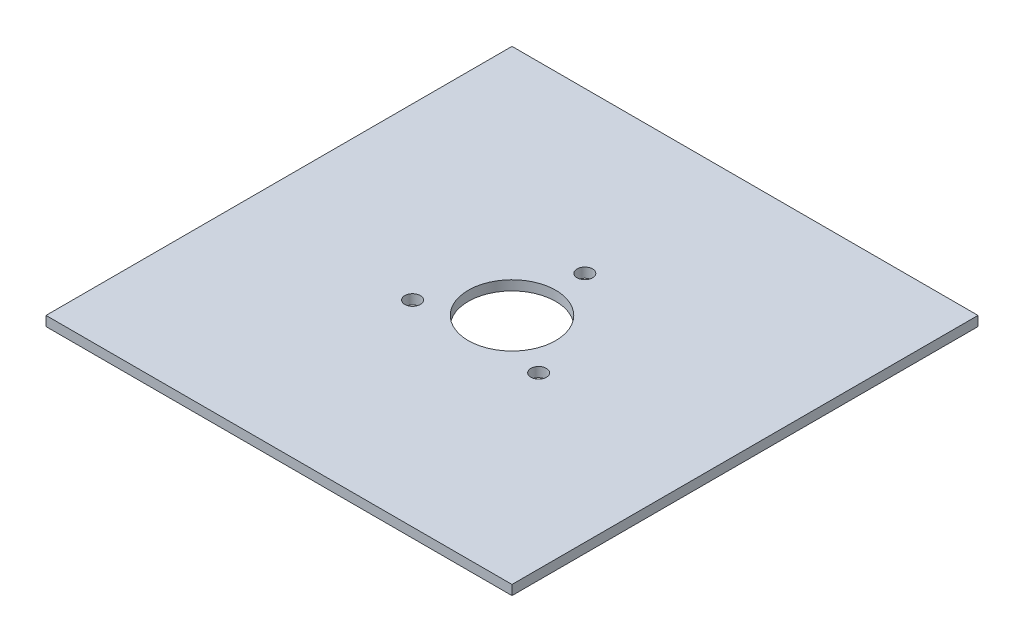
ISO-10303-21;
HEADER;
FILE_DESCRIPTION(('STEP AP214'),'2;1');
FILE_NAME('part.step','',(''),(''),'','','');
FILE_SCHEMA(('AUTOMOTIVE_DESIGN { 1 0 10303 214 1 1 1 1 }'));
ENDSEC;
DATA;
#1=APPLICATION_CONTEXT('core data for automotive mechanical design processes');
#2=APPLICATION_PROTOCOL_DEFINITION('international standard','automotive_design',2000,#1);
#3=PRODUCT_CONTEXT('',#1,'mechanical');
#4=PRODUCT('Part','Part','',(#3));
#5=PRODUCT_RELATED_PRODUCT_CATEGORY('part','',(#4));
#6=PRODUCT_DEFINITION_FORMATION('','',#4);
#7=PRODUCT_DEFINITION_CONTEXT('part definition',#1,'design');
#8=PRODUCT_DEFINITION('design','',#6,#7);
#9=PRODUCT_DEFINITION_SHAPE('','',#8);
#10=(LENGTH_UNIT() NAMED_UNIT(*) SI_UNIT(.MILLI.,.METRE.));
#11=(NAMED_UNIT(*) PLANE_ANGLE_UNIT() SI_UNIT($,.RADIAN.));
#12=(NAMED_UNIT(*) SI_UNIT($,.STERADIAN.) SOLID_ANGLE_UNIT());
#13=UNCERTAINTY_MEASURE_WITH_UNIT(LENGTH_MEASURE(1.E-05),#10,'distance_accuracy_value','');
#14=(GEOMETRIC_REPRESENTATION_CONTEXT(3) GLOBAL_UNCERTAINTY_ASSIGNED_CONTEXT((#13)) GLOBAL_UNIT_ASSIGNED_CONTEXT((#10,
#11,#12)) REPRESENTATION_CONTEXT('',''));
#15=CARTESIAN_POINT('',(0.,0.,0.));
#16=DIRECTION('',(0.,0.,1.));
#17=DIRECTION('',(1.,0.,0.));
#18=AXIS2_PLACEMENT_3D('',#15,#16,#17);
#19=CARTESIAN_POINT('',(76.2,1.5875,76.2));
#20=DIRECTION('',(-1.,0.,0.));
#21=DIRECTION('',(0.,0.,1.));
#22=AXIS2_PLACEMENT_3D('',#19,#20,#21);
#23=PLANE('',#22);
#24=DIRECTION('',(0.,0.,-1.));
#25=VECTOR('',#24,1.);
#26=CARTESIAN_POINT('',(76.2,-1.5875,76.2));
#27=LINE('',#26,#25);
#28=CARTESIAN_POINT('',(76.2,-1.5875,76.2));
#29=VERTEX_POINT('',#28);
#30=CARTESIAN_POINT('',(76.2,-1.5875,-76.2));
#31=VERTEX_POINT('',#30);
#32=EDGE_CURVE('E95',#29,#31,#27,.T.);
#33=ORIENTED_EDGE('',*,*,#32,.T.);
#34=DIRECTION('',(0.,-1.,0.));
#35=VECTOR('',#34,1.);
#36=CARTESIAN_POINT('',(76.2,1.5875,-76.2));
#37=LINE('',#36,#35);
#38=CARTESIAN_POINT('',(76.2,1.5875,-76.2));
#39=VERTEX_POINT('',#38);
#40=EDGE_CURVE('E11',#39,#31,#37,.T.);
#41=ORIENTED_EDGE('',*,*,#40,.F.);
#42=DIRECTION('',(0.,0.,-1.));
#43=VECTOR('',#42,1.);
#44=CARTESIAN_POINT('',(76.2,1.5875,76.2));
#45=LINE('',#44,#43);
#46=CARTESIAN_POINT('',(76.2,1.5875,76.2));
#47=VERTEX_POINT('',#46);
#48=EDGE_CURVE('E83',#47,#39,#45,.T.);
#49=ORIENTED_EDGE('',*,*,#48,.F.);
#50=DIRECTION('',(0.,-1.,0.));
#51=VECTOR('',#50,1.);
#52=CARTESIAN_POINT('',(76.2,1.5875,76.2));
#53=LINE('',#52,#51);
#54=EDGE_CURVE('E91',#47,#29,#53,.T.);
#55=ORIENTED_EDGE('',*,*,#54,.T.);
#56=EDGE_LOOP('',(#33,#41,#49,#55));
#57=FACE_BOUND('',#56,.T.);
#58=ADVANCED_FACE('F32',(#57),#23,.F.);
#59=CARTESIAN_POINT('',(-76.2,1.5875,-76.2));
#60=DIRECTION('',(0.,0.,1.));
#61=DIRECTION('',(1.,0.,0.));
#62=AXIS2_PLACEMENT_3D('',#59,#60,#61);
#63=PLANE('',#62);
#64=DIRECTION('',(-1.,0.,0.));
#65=VECTOR('',#64,1.);
#66=CARTESIAN_POINT('',(-76.2,-1.5875,-76.2));
#67=LINE('',#66,#65);
#68=CARTESIAN_POINT('',(-76.2,-1.5875,-76.2));
#69=VERTEX_POINT('',#68);
#70=EDGE_CURVE('E87',#31,#69,#67,.T.);
#71=ORIENTED_EDGE('',*,*,#70,.T.);
#72=DIRECTION('',(0.,-1.,0.));
#73=VECTOR('',#72,1.);
#74=CARTESIAN_POINT('',(-76.2,1.5875,-76.2));
#75=LINE('',#74,#73);
#76=CARTESIAN_POINT('',(-76.2,1.5875,-76.2));
#77=VERTEX_POINT('',#76);
#78=EDGE_CURVE('E40',#77,#69,#75,.T.);
#79=ORIENTED_EDGE('',*,*,#78,.F.);
#80=DIRECTION('',(-1.,0.,0.));
#81=VECTOR('',#80,1.);
#82=CARTESIAN_POINT('',(-76.2,1.5875,-76.2));
#83=LINE('',#82,#81);
#84=EDGE_CURVE('E78',#39,#77,#83,.T.);
#85=ORIENTED_EDGE('',*,*,#84,.F.);
#86=ORIENTED_EDGE('',*,*,#40,.T.);
#87=EDGE_LOOP('',(#71,#79,#85,#86));
#88=FACE_BOUND('',#87,.T.);
#89=ADVANCED_FACE('F86',(#88),#63,.F.);
#90=CARTESIAN_POINT('',(-76.2,1.5875,76.2));
#91=DIRECTION('',(1.,0.,0.));
#92=DIRECTION('',(0.,0.,-1.));
#93=AXIS2_PLACEMENT_3D('',#90,#91,#92);
#94=PLANE('',#93);
#95=DIRECTION('',(0.,0.,1.));
#96=VECTOR('',#95,1.);
#97=CARTESIAN_POINT('',(-76.2,-1.5875,76.2));
#98=LINE('',#97,#96);
#99=CARTESIAN_POINT('',(-76.2,-1.5875,76.2));
#100=VERTEX_POINT('',#99);
#101=EDGE_CURVE('E65',#69,#100,#98,.T.);
#102=ORIENTED_EDGE('',*,*,#101,.T.);
#103=DIRECTION('',(0.,-1.,0.));
#104=VECTOR('',#103,1.);
#105=CARTESIAN_POINT('',(-76.2,1.5875,76.2));
#106=LINE('',#105,#104);
#107=CARTESIAN_POINT('',(-76.2,1.5875,76.2));
#108=VERTEX_POINT('',#107);
#109=EDGE_CURVE('E88',#108,#100,#106,.T.);
#110=ORIENTED_EDGE('',*,*,#109,.F.);
#111=DIRECTION('',(0.,0.,1.));
#112=VECTOR('',#111,1.);
#113=CARTESIAN_POINT('',(-76.2,1.5875,76.2));
#114=LINE('',#113,#112);
#115=EDGE_CURVE('E81',#77,#108,#114,.T.);
#116=ORIENTED_EDGE('',*,*,#115,.F.);
#117=ORIENTED_EDGE('',*,*,#78,.T.);
#118=EDGE_LOOP('',(#102,#110,#116,#117));
#119=FACE_BOUND('',#118,.T.);
#120=ADVANCED_FACE('F89',(#119),#94,.F.);
#121=CARTESIAN_POINT('',(-76.2,1.5875,76.2));
#122=DIRECTION('',(0.,0.,-1.));
#123=DIRECTION('',(-1.,0.,0.));
#124=AXIS2_PLACEMENT_3D('',#121,#122,#123);
#125=PLANE('',#124);
#126=DIRECTION('',(1.,0.,0.));
#127=VECTOR('',#126,1.);
#128=CARTESIAN_POINT('',(-76.2,-1.5875,76.2));
#129=LINE('',#128,#127);
#130=EDGE_CURVE('E71',#100,#29,#129,.T.);
#131=ORIENTED_EDGE('',*,*,#130,.T.);
#132=ORIENTED_EDGE('',*,*,#54,.F.);
#133=DIRECTION('',(1.,0.,0.));
#134=VECTOR('',#133,1.);
#135=CARTESIAN_POINT('',(-76.2,1.5875,76.2));
#136=LINE('',#135,#134);
#137=EDGE_CURVE('E48',#108,#47,#136,.T.);
#138=ORIENTED_EDGE('',*,*,#137,.F.);
#139=ORIENTED_EDGE('',*,*,#109,.T.);
#140=EDGE_LOOP('',(#131,#132,#138,#139));
#141=FACE_BOUND('',#140,.T.);
#142=ADVANCED_FACE('F103',(#141),#125,.F.);
#143=CARTESIAN_POINT('',(76.1999999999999,1.5875,-76.2));
#144=DIRECTION('',(0.,-1.,0.));
#145=DIRECTION('',(0.,0.,-1.));
#146=AXIS2_PLACEMENT_3D('',#143,#144,#145);
#147=PLANE('',#146);
#148=CARTESIAN_POINT('',(-20.6222299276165,1.5875,11.9062500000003));
#149=DIRECTION('',(0.,1.,0.));
#150=DIRECTION('',(0.,0.,1.));
#151=AXIS2_PLACEMENT_3D('',#148,#149,#150);
#152=CIRCLE('',#151,2.54);
#153=CARTESIAN_POINT('',(-20.6222299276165,1.5875,14.4462500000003));
#154=VERTEX_POINT('',#153);
#155=EDGE_CURVE('E127',#154,#154,#152,.T.);
#156=ORIENTED_EDGE('',*,*,#155,.F.);
#157=EDGE_LOOP('',(#156));
#158=FACE_BOUND('',#157,.T.);
#159=CARTESIAN_POINT('',(20.6222299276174,1.5875,11.9062499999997));
#160=DIRECTION('',(0.,1.,0.));
#161=DIRECTION('',(0.,0.,1.));
#162=AXIS2_PLACEMENT_3D('',#159,#160,#161);
#163=CIRCLE('',#162,2.54);
#164=CARTESIAN_POINT('',(20.6222299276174,1.5875,14.4462499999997));
#165=VERTEX_POINT('',#164);
#166=EDGE_CURVE('E121',#165,#165,#163,.T.);
#167=ORIENTED_EDGE('',*,*,#166,.F.);
#168=EDGE_LOOP('',(#167));
#169=FACE_BOUND('',#168,.T.);
#170=CARTESIAN_POINT('',(0.,1.5875,-23.8125));
#171=DIRECTION('',(0.,1.,0.));
#172=DIRECTION('',(0.,0.,1.));
#173=AXIS2_PLACEMENT_3D('',#170,#171,#172);
#174=CIRCLE('',#173,2.54);
#175=CARTESIAN_POINT('',(0.,1.5875,-21.2725));
#176=VERTEX_POINT('',#175);
#177=EDGE_CURVE('E115',#176,#176,#174,.T.);
#178=ORIENTED_EDGE('',*,*,#177,.F.);
#179=EDGE_LOOP('',(#178));
#180=FACE_BOUND('',#179,.T.);
#181=CARTESIAN_POINT('',(0.,1.5875,0.));
#182=DIRECTION('',(0.,1.,0.));
#183=DIRECTION('',(0.,0.,1.));
#184=AXIS2_PLACEMENT_3D('',#181,#182,#183);
#185=CIRCLE('',#184,14.2875);
#186=CARTESIAN_POINT('',(0.,1.5875,14.2875));
#187=VERTEX_POINT('',#186);
#188=EDGE_CURVE('E109',#187,#187,#185,.T.);
#189=ORIENTED_EDGE('',*,*,#188,.F.);
#190=EDGE_LOOP('',(#189));
#191=FACE_BOUND('',#190,.T.);
#192=ORIENTED_EDGE('',*,*,#48,.T.);
#193=ORIENTED_EDGE('',*,*,#84,.T.);
#194=ORIENTED_EDGE('',*,*,#115,.T.);
#195=ORIENTED_EDGE('',*,*,#137,.T.);
#196=EDGE_LOOP('',(#192,#193,#194,#195));
#197=FACE_BOUND('',#196,.T.);
#198=ADVANCED_FACE('F79',(#158,#169,#180,#191,#197),#147,.F.);
#199=CARTESIAN_POINT('',(76.1999999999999,-1.5875,-76.2));
#200=DIRECTION('',(0.,-1.,0.));
#201=DIRECTION('',(0.,0.,-1.));
#202=AXIS2_PLACEMENT_3D('',#199,#200,#201);
#203=PLANE('',#202);
#204=CARTESIAN_POINT('',(-20.6222299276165,-1.5875,11.9062500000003));
#205=DIRECTION('',(0.,1.,0.));
#206=DIRECTION('',(0.,0.,1.));
#207=AXIS2_PLACEMENT_3D('',#204,#205,#206);
#208=CIRCLE('',#207,2.54);
#209=CARTESIAN_POINT('',(-20.6222299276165,-1.5875,14.4462500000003));
#210=VERTEX_POINT('',#209);
#211=EDGE_CURVE('E124',#210,#210,#208,.T.);
#212=ORIENTED_EDGE('',*,*,#211,.T.);
#213=EDGE_LOOP('',(#212));
#214=FACE_BOUND('',#213,.T.);
#215=CARTESIAN_POINT('',(20.6222299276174,-1.5875,11.9062499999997));
#216=DIRECTION('',(0.,1.,0.));
#217=DIRECTION('',(0.,0.,1.));
#218=AXIS2_PLACEMENT_3D('',#215,#216,#217);
#219=CIRCLE('',#218,2.54);
#220=CARTESIAN_POINT('',(20.6222299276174,-1.5875,14.4462499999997));
#221=VERTEX_POINT('',#220);
#222=EDGE_CURVE('E118',#221,#221,#219,.T.);
#223=ORIENTED_EDGE('',*,*,#222,.T.);
#224=EDGE_LOOP('',(#223));
#225=FACE_BOUND('',#224,.T.);
#226=CARTESIAN_POINT('',(0.,-1.5875,-23.8125));
#227=DIRECTION('',(0.,1.,0.));
#228=DIRECTION('',(0.,0.,1.));
#229=AXIS2_PLACEMENT_3D('',#226,#227,#228);
#230=CIRCLE('',#229,2.54);
#231=CARTESIAN_POINT('',(0.,-1.5875,-21.2725));
#232=VERTEX_POINT('',#231);
#233=EDGE_CURVE('E112',#232,#232,#230,.T.);
#234=ORIENTED_EDGE('',*,*,#233,.T.);
#235=EDGE_LOOP('',(#234));
#236=FACE_BOUND('',#235,.T.);
#237=CARTESIAN_POINT('',(0.,-1.5875,0.));
#238=DIRECTION('',(0.,1.,0.));
#239=DIRECTION('',(0.,0.,1.));
#240=AXIS2_PLACEMENT_3D('',#237,#238,#239);
#241=CIRCLE('',#240,14.2875);
#242=CARTESIAN_POINT('',(0.,-1.5875,14.2875));
#243=VERTEX_POINT('',#242);
#244=EDGE_CURVE('E98',#243,#243,#241,.T.);
#245=ORIENTED_EDGE('',*,*,#244,.T.);
#246=EDGE_LOOP('',(#245));
#247=FACE_BOUND('',#246,.T.);
#248=ORIENTED_EDGE('',*,*,#32,.F.);
#249=ORIENTED_EDGE('',*,*,#130,.F.);
#250=ORIENTED_EDGE('',*,*,#101,.F.);
#251=ORIENTED_EDGE('',*,*,#70,.F.);
#252=EDGE_LOOP('',(#248,#249,#250,#251));
#253=FACE_BOUND('',#252,.T.);
#254=ADVANCED_FACE('F106',(#214,#225,#236,#247,#253),#203,.T.);
#255=CARTESIAN_POINT('',(0.,-1.5875,0.));
#256=DIRECTION('',(0.,1.,0.));
#257=DIRECTION('',(0.,0.,1.));
#258=AXIS2_PLACEMENT_3D('',#255,#256,#257);
#259=CYLINDRICAL_SURFACE('',#258,14.2875);
#260=ORIENTED_EDGE('',*,*,#244,.F.);
#261=EDGE_LOOP('',(#260));
#262=FACE_BOUND('',#261,.T.);
#263=ORIENTED_EDGE('',*,*,#188,.T.);
#264=EDGE_LOOP('',(#263));
#265=FACE_BOUND('',#264,.T.);
#266=ADVANCED_FACE('F151',(#262,#265),#259,.F.);
#267=CARTESIAN_POINT('',(0.,-1.5875,-23.8125));
#268=DIRECTION('',(0.,1.,0.));
#269=DIRECTION('',(0.,0.,1.));
#270=AXIS2_PLACEMENT_3D('',#267,#268,#269);
#271=CYLINDRICAL_SURFACE('',#270,2.54);
#272=ORIENTED_EDGE('',*,*,#233,.F.);
#273=EDGE_LOOP('',(#272));
#274=FACE_BOUND('',#273,.T.);
#275=ORIENTED_EDGE('',*,*,#177,.T.);
#276=EDGE_LOOP('',(#275));
#277=FACE_BOUND('',#276,.T.);
#278=ADVANCED_FACE('F153',(#274,#277),#271,.F.);
#279=CARTESIAN_POINT('',(20.6222299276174,-1.5875,11.9062499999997));
#280=DIRECTION('',(0.,1.,0.));
#281=DIRECTION('',(0.,0.,1.));
#282=AXIS2_PLACEMENT_3D('',#279,#280,#281);
#283=CYLINDRICAL_SURFACE('',#282,2.54);
#284=ORIENTED_EDGE('',*,*,#222,.F.);
#285=EDGE_LOOP('',(#284));
#286=FACE_BOUND('',#285,.T.);
#287=ORIENTED_EDGE('',*,*,#166,.T.);
#288=EDGE_LOOP('',(#287));
#289=FACE_BOUND('',#288,.T.);
#290=ADVANCED_FACE('F138',(#286,#289),#283,.F.);
#291=CARTESIAN_POINT('',(-20.6222299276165,-1.5875,11.9062500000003));
#292=DIRECTION('',(0.,1.,0.));
#293=DIRECTION('',(0.,0.,1.));
#294=AXIS2_PLACEMENT_3D('',#291,#292,#293);
#295=CYLINDRICAL_SURFACE('',#294,2.54);
#296=ORIENTED_EDGE('',*,*,#211,.F.);
#297=EDGE_LOOP('',(#296));
#298=FACE_BOUND('',#297,.T.);
#299=ORIENTED_EDGE('',*,*,#155,.T.);
#300=EDGE_LOOP('',(#299));
#301=FACE_BOUND('',#300,.T.);
#302=ADVANCED_FACE('F135',(#298,#301),#295,.F.);
#303=CLOSED_SHELL('',(#58,#89,#120,#142,#198,#254,#266,#278,#290,#302));
#304=MANIFOLD_SOLID_BREP('B2',#303);
#305=ADVANCED_BREP_SHAPE_REPRESENTATION('',(#18,#304),#14);
#306=SHAPE_DEFINITION_REPRESENTATION(#9,#305);
ENDSEC;
END-ISO-10303-21;
